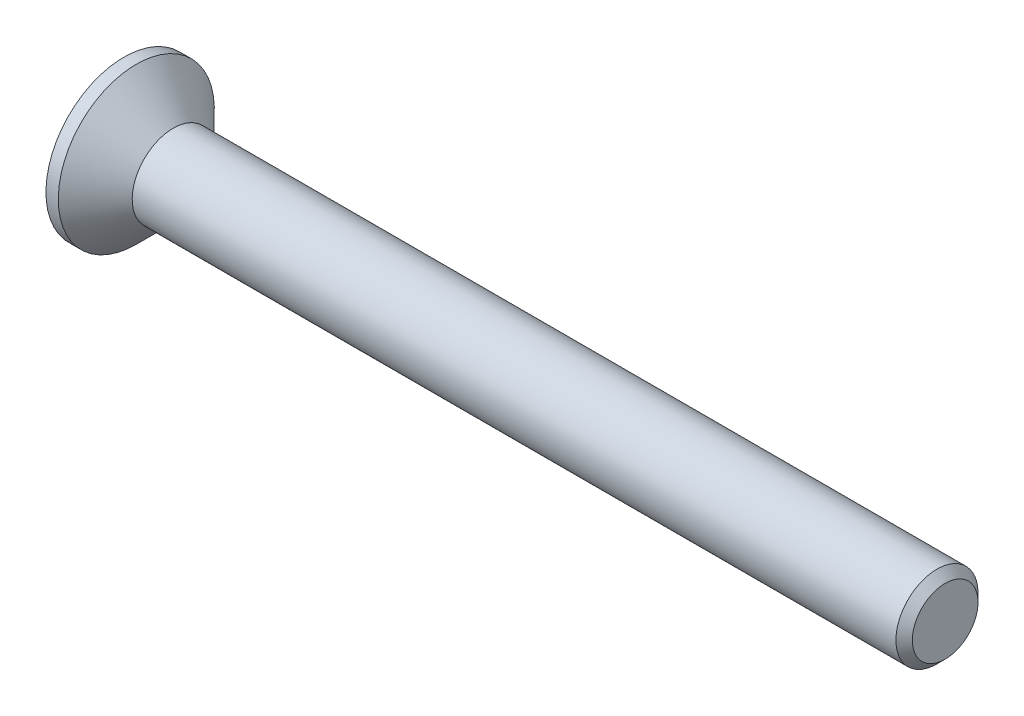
from build123d import *

# Parameters (mm, degrees)
CHAMFER1_SIZE      = 0.2
CUT_EXTRUDE1_DEPTH = 0.95


with BuildPart() as part:
    # Sketch1 → Revolve1 (revolve)
    with BuildSketch(Plane.XY, mode=Mode.PRIVATE) as revolve1_sk:
        Polygon((-1.2, 1.9), (-1.2, 0), (18.8, 0), (18.8, 1), (0, 1), (-0.9, 1.9), align=None)
    revolve(revolve1_sk.sketch.rotate(Axis((-1.2, 0, 0), (1, 0, 0)), 180), axis=Axis((-1.2, 0, 0), (1, 0, 0)))

    # Chamfer1
    chamfer1_edges = [part.edges().sort_by_distance(p)[0] for p in [
        (18.8, 1, 0),
    ]]
    chamfer(chamfer1_edges, length=CHAMFER1_SIZE)

    # Sketch2 → Cut-Extrude1 (cut)
    with BuildSketch(Plane.ZY.offset(1.2)):
        Polygon((-0.3, 1.175), (0.3, 1.175), (0.3, 0.3), (1.175, 0.3), (1.175, -0.3), (0.3, -0.3), (0.3, -1.175), (-0.3, -1.175), (-0.3, -0.3), (-1.175, -0.3), (-1.175, 0.3), (-0.3, 0.3), align=None)
    extrude(amount=-CUT_EXTRUDE1_DEPTH, mode=Mode.SUBTRACT)


solid = part.part
